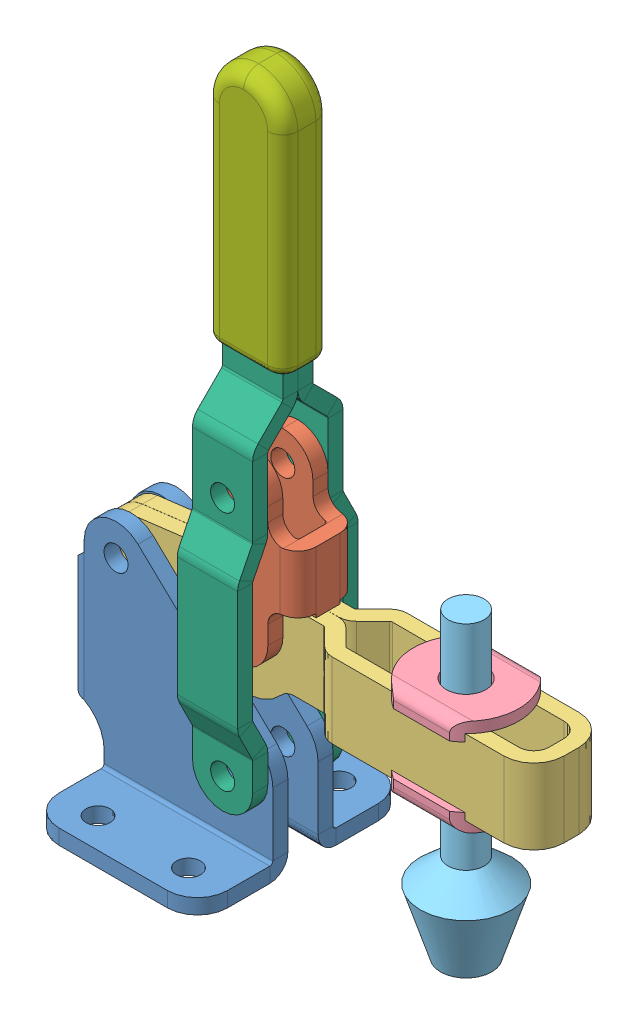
SolidWorks assembly collision_&.sldasm, configuration Default (file format 3100). Lengths in mm.
Overall size (99.55 143.38 44.45).
11 component instances, 7 part files, 10 mates.
Components (placement in the parent):
- base_&-1: base_&.SLDPRT [Default] at origin size (42.93 49.25 44.45)
- link_&-1: link_&.SLDPRT [Default] at (35.5076 67.945 0) x (0.001109 -0.999999 0) z (0 0 1) size (38.1 19.05 12.7)
- hold-down sub-assy_&-1: hold-down sub-assy_&.SLDASM [Default] at (3.5318 33.02 -6.35) x (1 0.000001 0) z (0 0 1) size (96.01 63.5 19.3)
  - arm_&-1: arm_&.SLDPRT [Default] at origin size (96.01 23.62 15.88)
  - washer_&-1: washer_&.SLDPRT [Default] at (73.787 -2.286 0) x (0 0 -1) z (1 0 0) size (18.8 3.81 22.23)
  - washer_&-2: washer_&.SLDPRT [Default] at (73.787 18.161 0) x (0 0 -1) z (-1 0 0) size (18.8 3.81 22.23)
  - hold-down bolt_&-1: hold-down bolt_&.sldprt [Default] at (73.787 -32.766 0) size (19.3 63.5 19.3)
- handle sub-assy_&-1: handle sub-assy_&.sldasm [Default] at (6.2447 13.1359 -12.7) x (0.000202 -1 0) z (0 0 1) size (132.59 16.51 25.4)
  - handle-half_&-1: handle-half_&.SLDPRT [Default] at (2.3468 22.924 12.7) size (130.68 12.7 12.7)
  - handle-half_&-2: handle-half_&.SLDPRT [Default] at (2.3468 35.624 0) x (1 0 0) z (0 0 -1) size (130.68 12.7 12.7)
  - sleeve_&-1: sleeve_&.sldprt [Default] at (-128.3362 22.924 3.175) size (52.77 16.51 10.16)
Mates (geometry in assembly coordinates):
- MateCoincident15: coincident aligned: plane of base_&-1; plane of assembly
- MateCoincident16: coincident anti-aligned: plane of base_&-1; plane of assembly
- MateCoincident17: coincident anti-aligned: plane of base_&-1; plane of assembly
- MateConcentric10: concentric aligned: cylinder of base_&-1; cylinder of handle sub-assy_&-1/handle-half_&-1
- MateCoincident20: coincident anti-aligned: plane of base_&-1; plane of handle sub-assy_&-1/handle-half_&-1
- MateConcentric11: concentric aligned: cylinder of handle sub-assy_&-1/handle-half_&-1; cylinder of link_&-1
- MateCoincident21: coincident anti-aligned: plane of handle sub-assy_&-1/handle-half_&-1; plane of link_&-1
- Concentric1: concentric aligned: cylinder of base_&-1; cylinder of hold-down sub-assy_&-1/arm_&-1
- Coincident1: coincident anti-aligned: plane of base_&-1; plane of hold-down sub-assy_&-1/arm_&-1
- Concentric2: concentric aligned: cylinder of hold-down sub-assy_&-1/arm_&-1; cylinder of link_&-1
